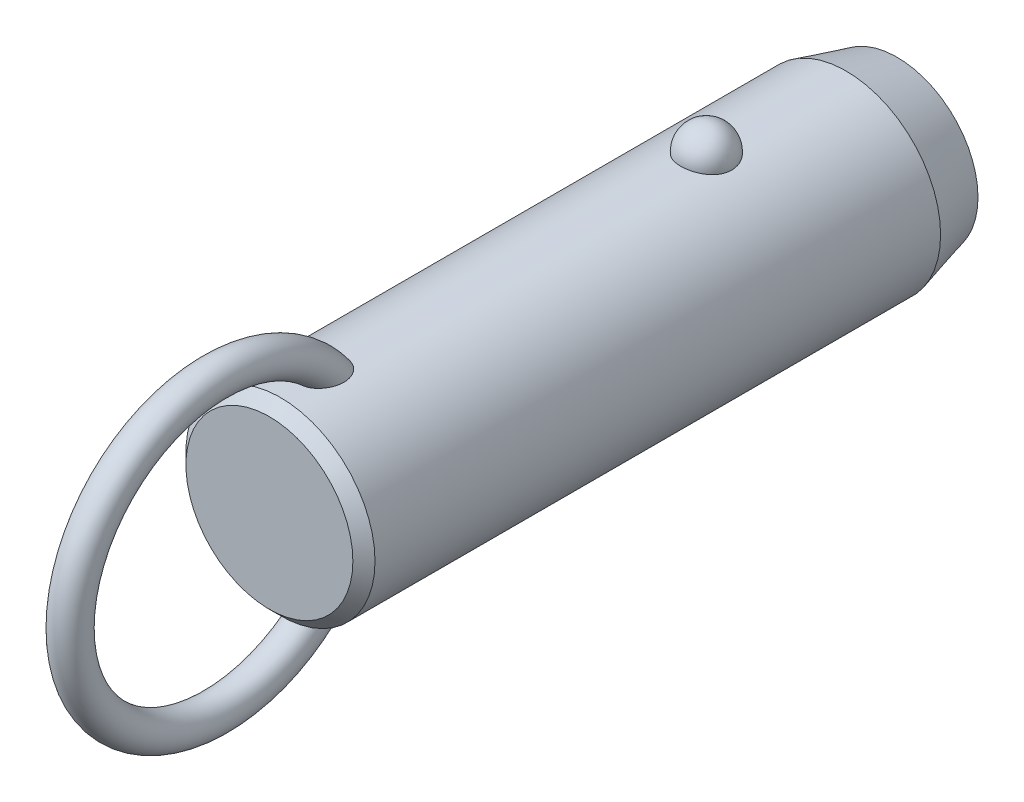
ISO-10303-21;
HEADER;
FILE_DESCRIPTION(('STEP AP214'),'2;1');
FILE_NAME('part.step','',(''),(''),'','','');
FILE_SCHEMA(('AUTOMOTIVE_DESIGN { 1 0 10303 214 1 1 1 1 }'));
ENDSEC;
DATA;
#1=APPLICATION_CONTEXT('core data for automotive mechanical design processes');
#2=APPLICATION_PROTOCOL_DEFINITION('international standard','automotive_design',2000,#1);
#3=PRODUCT_CONTEXT('',#1,'mechanical');
#4=PRODUCT('Part','Part','',(#3));
#5=PRODUCT_RELATED_PRODUCT_CATEGORY('part','',(#4));
#6=PRODUCT_DEFINITION_FORMATION('','',#4);
#7=PRODUCT_DEFINITION_CONTEXT('part definition',#1,'design');
#8=PRODUCT_DEFINITION('design','',#6,#7);
#9=PRODUCT_DEFINITION_SHAPE('','',#8);
#10=(LENGTH_UNIT() NAMED_UNIT(*) SI_UNIT(.MILLI.,.METRE.));
#11=(NAMED_UNIT(*) PLANE_ANGLE_UNIT() SI_UNIT($,.RADIAN.));
#12=(NAMED_UNIT(*) SI_UNIT($,.STERADIAN.) SOLID_ANGLE_UNIT());
#13=UNCERTAINTY_MEASURE_WITH_UNIT(LENGTH_MEASURE(1.E-05),#10,'distance_accuracy_value','');
#14=(GEOMETRIC_REPRESENTATION_CONTEXT(3) GLOBAL_UNCERTAINTY_ASSIGNED_CONTEXT((#13)) GLOBAL_UNIT_ASSIGNED_CONTEXT((#10,
#11,#12)) REPRESENTATION_CONTEXT('',''));
#15=CARTESIAN_POINT('',(0.,0.,0.));
#16=DIRECTION('',(0.,0.,1.));
#17=DIRECTION('',(1.,0.,0.));
#18=AXIS2_PLACEMENT_3D('',#15,#16,#17);
#19=CARTESIAN_POINT('',(0.,0.,35.6));
#20=DIRECTION('',(0.,0.,-1.));
#21=DIRECTION('',(-1.,0.,0.));
#22=AXIS2_PLACEMENT_3D('',#19,#20,#21);
#23=CYLINDRICAL_SURFACE('',#22,11.1);
#24=CARTESIAN_POINT('',(2.9724815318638,10.6945945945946,-3.));
#25=CARTESIAN_POINT('',(2.97247830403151,10.6945972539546,-2.83225059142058));
#26=CARTESIAN_POINT('',(2.95876598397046,10.6984356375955,-2.6644597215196));
#27=CARTESIAN_POINT('',(2.90424529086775,10.7133624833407,-2.33362381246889));
#28=CARTESIAN_POINT('',(2.8634252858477,10.7244540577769,-2.1705808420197));
#29=CARTESIAN_POINT('',(2.75573657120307,10.7526272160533,-1.85396767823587));
#30=CARTESIAN_POINT('',(2.68887937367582,10.7697061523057,-1.70039333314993));
#31=CARTESIAN_POINT('',(2.53079696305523,10.8079438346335,-1.40691598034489));
#32=CARTESIAN_POINT('',(2.43957264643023,10.8291024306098,-1.2670124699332));
#33=CARTESIAN_POINT('',(2.23458150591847,10.8732541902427,-1.00409565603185));
#34=CARTESIAN_POINT('',(2.12071295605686,10.8962553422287,-0.881162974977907));
#35=CARTESIAN_POINT('',(1.87365402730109,10.9414421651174,-0.656352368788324));
#36=CARTESIAN_POINT('',(1.74046358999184,10.9636278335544,-0.554474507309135));
#37=CARTESIAN_POINT('',(1.45872188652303,11.0046495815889,-0.374872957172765));
#38=CARTESIAN_POINT('',(1.31021276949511,11.0234944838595,-0.29708522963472));
#39=CARTESIAN_POINT('',(1.00170030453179,11.0557957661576,-0.167529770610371));
#40=CARTESIAN_POINT('',(0.841698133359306,11.0692526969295,-0.115759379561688));
#41=CARTESIAN_POINT('',(0.517607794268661,11.0890932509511,-0.0403925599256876));
#42=CARTESIAN_POINT('',(0.353633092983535,11.0955916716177,-0.0163383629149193));
#43=CARTESIAN_POINT('',(0.0238420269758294,11.1011989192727,0.00445177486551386));
#44=CARTESIAN_POINT('',(-0.141974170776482,11.1003084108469,0.00119017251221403));
#45=CARTESIAN_POINT('',(-0.468405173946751,11.0912990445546,-0.0323233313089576));
#46=CARTESIAN_POINT('',(-0.629059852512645,11.0832767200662,-0.0622147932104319));
#47=CARTESIAN_POINT('',(-0.942937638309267,11.0609962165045,-0.147645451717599));
#48=CARTESIAN_POINT('',(-1.09616062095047,11.0467379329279,-0.203185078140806));
#49=CARTESIAN_POINT('',(-1.39181061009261,11.0134071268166,-0.338752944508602));
#50=CARTESIAN_POINT('',(-1.53417383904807,10.9943086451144,-0.418913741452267));
#51=CARTESIAN_POINT('',(-1.80342160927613,10.9533667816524,-0.601448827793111));
#52=CARTESIAN_POINT('',(-1.9303046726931,10.9315231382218,-0.70382523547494));
#53=CARTESIAN_POINT('',(-2.16747598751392,10.887005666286,-0.930091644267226));
#54=CARTESIAN_POINT('',(-2.27742774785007,10.8643239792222,-1.05433291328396));
#55=CARTESIAN_POINT('',(-2.47517316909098,10.8209886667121,-1.31966633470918));
#56=CARTESIAN_POINT('',(-2.56296538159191,10.8003351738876,-1.46075958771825));
#57=CARTESIAN_POINT('',(-2.71500300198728,10.7631304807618,-1.75753646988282));
#58=CARTESIAN_POINT('',(-2.77898901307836,10.7466250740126,-1.91335887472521));
#59=CARTESIAN_POINT('',(-2.88046189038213,10.7198747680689,-2.2339152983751));
#60=CARTESIAN_POINT('',(-2.91794947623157,10.709629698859,-2.39864907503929));
#61=CARTESIAN_POINT('',(-2.96537819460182,10.6965949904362,-2.73165170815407));
#62=CARTESIAN_POINT('',(-2.97542891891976,10.693775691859,-2.89990378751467));
#63=CARTESIAN_POINT('',(-2.96804271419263,10.6958279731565,-3.235752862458));
#64=CARTESIAN_POINT('',(-2.95060646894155,10.7006993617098,-3.40334987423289));
#65=CARTESIAN_POINT('',(-2.88883358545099,10.71753912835,-3.73233906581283));
#66=CARTESIAN_POINT('',(-2.84462026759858,10.7294749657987,-3.89375610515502));
#67=CARTESIAN_POINT('',(-2.73050447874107,10.7590797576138,-4.20667949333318));
#68=CARTESIAN_POINT('',(-2.66060103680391,10.7767489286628,-4.35818546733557));
#69=CARTESIAN_POINT('',(-2.49642559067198,10.8159599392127,-4.6478542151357));
#70=CARTESIAN_POINT('',(-2.40203047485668,10.8375211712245,-4.78594458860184));
#71=CARTESIAN_POINT('',(-2.19143488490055,10.8820570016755,-5.0441038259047));
#72=CARTESIAN_POINT('',(-2.07523364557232,10.9050316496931,-5.16417205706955));
#73=CARTESIAN_POINT('',(-1.82361254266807,10.9499219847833,-5.38334833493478));
#74=CARTESIAN_POINT('',(-1.68812945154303,10.9718338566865,-5.48238464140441));
#75=CARTESIAN_POINT('',(-1.40191298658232,11.0120611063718,-5.65618873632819));
#76=CARTESIAN_POINT('',(-1.25118062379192,11.0303767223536,-5.73095813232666));
#77=CARTESIAN_POINT('',(-0.940570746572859,11.0611653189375,-5.85334725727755));
#78=CARTESIAN_POINT('',(-0.780821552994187,11.0737044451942,-5.901275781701));
#79=CARTESIAN_POINT('',(-0.455204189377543,11.0918598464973,-5.96992976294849));
#80=CARTESIAN_POINT('',(-0.289336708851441,11.0974768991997,-5.99065827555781));
#81=CARTESIAN_POINT('',(0.0406846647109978,11.1011307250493,-6.00418773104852));
#82=CARTESIAN_POINT('',(0.204817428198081,11.099299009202,-5.99747318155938));
#83=CARTESIAN_POINT('',(0.5295530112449,11.088551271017,-5.9574031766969));
#84=CARTESIAN_POINT('',(0.69015594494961,11.0796354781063,-5.92404858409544));
#85=CARTESIAN_POINT('',(1.0027760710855,11.0557204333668,-5.83180084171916));
#86=CARTESIAN_POINT('',(1.15482001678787,11.0407414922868,-5.77299291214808));
#87=CARTESIAN_POINT('',(1.44678373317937,11.0062913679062,-5.63147366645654));
#88=CARTESIAN_POINT('',(1.58670279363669,10.9868199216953,-5.54876095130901));
#89=CARTESIAN_POINT('',(1.8527023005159,10.9451315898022,-5.36027644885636));
#90=CARTESIAN_POINT('',(1.97855158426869,10.9228788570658,-5.25418644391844));
#91=CARTESIAN_POINT('',(2.21080872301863,10.8782509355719,-5.02251354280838));
#92=CARTESIAN_POINT('',(2.31721312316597,10.8558757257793,-4.89692718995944));
#93=CARTESIAN_POINT('',(2.5094551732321,10.8130715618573,-4.62745408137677));
#94=CARTESIAN_POINT('',(2.59493284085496,10.7926798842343,-4.48330448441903));
#95=CARTESIAN_POINT('',(2.740862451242,10.7565495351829,-4.18236358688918));
#96=CARTESIAN_POINT('',(2.80132490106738,10.7408089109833,-4.02557762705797));
#97=CARTESIAN_POINT('',(2.88959070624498,10.7173718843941,-3.72475308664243));
#98=CARTESIAN_POINT('',(2.92062102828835,10.7088950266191,-3.58171216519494));
#99=CARTESIAN_POINT('',(2.96206765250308,10.6975052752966,-3.29245795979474));
#100=CARTESIAN_POINT('',(2.97248434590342,10.6945922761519,-3.14624473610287));
#101=CARTESIAN_POINT('',(2.9724815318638,10.6945945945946,-3.));
#102=B_SPLINE_CURVE_WITH_KNOTS('',3,(#24,#25,#26,#27,#28,#29,#30,#31,#32,#33,#34,#35,#36,#37,
#38,#39,#40,#41,#42,#43,#44,#45,#46,#47,#48,#49,#50,#51,#52,#53,#54,#55,#56,#57,#58,#59,#60,#61,
#62,#63,#64,#65,#66,#67,#68,#69,#70,#71,#72,#73,#74,#75,#76,#77,#78,#79,#80,#81,#82,#83,#84,#85,
#86,#87,#88,#89,#90,#91,#92,#93,#94,#95,#96,#97,#98,#99,#100,#101),.UNSPECIFIED.,.T.,.F.,(4,2,2,
2,2,2,2,2,2,2,2,2,2,2,2,2,2,2,2,2,2,2,2,2,2,2,2,2,2,2,2,2,2,2,2,2,2,2,4),(0.,0.502722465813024,
1.00566079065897,1.5083769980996,2.01107471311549,2.51608392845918,3.02109467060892,
3.52475118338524,4.02835620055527,4.523518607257,5.0186364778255,5.50715297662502,
5.9956776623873,6.48688002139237,6.97812923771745,7.47814366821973,7.9781907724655,
8.48353712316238,8.9888697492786,9.49218093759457,9.99547960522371,10.4964777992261,
10.997494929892,11.5010810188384,12.0046847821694,12.5099796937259,13.0152411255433,
13.5145635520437,14.0138298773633,14.5043200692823,14.9947943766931,15.4836390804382,
15.9725123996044,16.4685040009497,16.9645836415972,17.4686765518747,17.972557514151,
18.410841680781,18.849117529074),.UNSPECIFIED.);
#103=CARTESIAN_POINT('',(2.9724815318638,10.6945945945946,-3.));
#104=VERTEX_POINT('',#103);
#105=EDGE_CURVE('E41',#104,#104,#102,.T.);
#106=ORIENTED_EDGE('',*,*,#105,.T.);
#107=EDGE_LOOP('',(#106));
#108=FACE_BOUND('',#107,.T.);
#109=CARTESIAN_POINT('',(0.,0.,47.));
#110=DIRECTION('',(0.,0.,1.));
#111=DIRECTION('',(1.,0.,0.));
#112=AXIS2_PLACEMENT_3D('',#109,#110,#111);
#113=CIRCLE('',#112,11.1);
#114=CARTESIAN_POINT('',(11.1,0.,47.));
#115=VERTEX_POINT('',#114);
#116=EDGE_CURVE('E10',#115,#115,#113,.F.);
#117=ORIENTED_EDGE('',*,*,#116,.T.);
#118=EDGE_LOOP('',(#117));
#119=FACE_BOUND('',#118,.T.);
#120=CARTESIAN_POINT('',(-0.564520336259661,-11.0856356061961,39.257815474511));
#121=CARTESIAN_POINT('',(-0.667202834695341,-11.0804062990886,39.2912839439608));
#122=CARTESIAN_POINT('',(-0.766875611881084,-11.0738877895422,39.3338357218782));
#123=CARTESIAN_POINT('',(-0.957284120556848,-11.0590576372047,39.4354190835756));
#124=CARTESIAN_POINT('',(-1.04801616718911,-11.0507452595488,39.4944574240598));
#125=CARTESIAN_POINT('',(-1.21800952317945,-11.0333016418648,39.6265293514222));
#126=CARTESIAN_POINT('',(-1.29730805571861,-11.0241732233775,39.6995156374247));
#127=CARTESIAN_POINT('',(-1.44337665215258,-11.0060026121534,39.8570374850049));
#128=CARTESIAN_POINT('',(-1.51014622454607,-10.9969604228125,39.9415734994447));
#129=CARTESIAN_POINT('',(-1.63454620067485,-10.9791841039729,40.1255213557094));
#130=CARTESIAN_POINT('',(-1.69127003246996,-10.9705107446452,40.2255493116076));
#131=CARTESIAN_POINT('',(-1.78980785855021,-10.9548648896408,40.4327902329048));
#132=CARTESIAN_POINT('',(-1.83161214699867,-10.9478935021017,40.5400078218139));
#133=CARTESIAN_POINT('',(-1.91557028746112,-10.9335803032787,40.8054080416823));
#134=CARTESIAN_POINT('',(-1.95040620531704,-10.9273269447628,40.9659806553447));
#135=CARTESIAN_POINT('',(-1.99388326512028,-10.9194709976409,41.2906977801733));
#136=CARTESIAN_POINT('',(-2.00248051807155,-10.9178762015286,41.4548478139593));
#137=CARTESIAN_POINT('',(-1.99551615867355,-10.9191578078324,41.8246504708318));
#138=CARTESIAN_POINT('',(-1.9732206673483,-10.9232807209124,42.0301911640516));
#139=CARTESIAN_POINT('',(-1.9152976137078,-10.9335244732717,42.333595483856));
#140=CARTESIAN_POINT('',(-1.89184575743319,-10.9376266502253,42.4340883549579));
#141=CARTESIAN_POINT('',(-1.83700674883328,-10.9469720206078,42.632855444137));
#142=CARTESIAN_POINT('',(-1.80562070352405,-10.9522150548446,42.7311299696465));
#143=CARTESIAN_POINT('',(-1.73463055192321,-10.9636837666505,42.9259148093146));
#144=CARTESIAN_POINT('',(-1.69493416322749,-10.9699202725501,43.0223907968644));
#145=CARTESIAN_POINT('',(-1.60745141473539,-10.9830806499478,43.2116262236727));
#146=CARTESIAN_POINT('',(-1.55966150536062,-10.9900048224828,43.3043840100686));
#147=CARTESIAN_POINT('',(-1.45591812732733,-11.0042280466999,43.4846907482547));
#148=CARTESIAN_POINT('',(-1.40000013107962,-11.0115253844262,43.5722601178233));
#149=CARTESIAN_POINT('',(-1.27937470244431,-11.0261911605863,43.741029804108));
#150=CARTESIAN_POINT('',(-1.21467835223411,-11.0335594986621,43.8222379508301));
#151=CARTESIAN_POINT('',(-1.08218150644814,-11.0473027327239,43.9690010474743));
#152=CARTESIAN_POINT('',(-1.01522633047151,-11.0537063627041,44.0353092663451));
#153=CARTESIAN_POINT('',(-0.872952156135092,-11.065850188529,44.1583780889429));
#154=CARTESIAN_POINT('',(-0.797642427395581,-11.0715911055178,44.2151491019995));
#155=CARTESIAN_POINT('',(-0.651396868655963,-11.081071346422,44.3075155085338));
#156=CARTESIAN_POINT('',(-0.581712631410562,-11.0849841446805,44.3450491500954));
#157=CARTESIAN_POINT('',(-0.437066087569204,-11.0916271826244,44.4082594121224));
#158=CARTESIAN_POINT('',(-0.362109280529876,-11.0943586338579,44.4339481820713));
#159=CARTESIAN_POINT('',(-0.207828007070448,-11.0983242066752,44.471117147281));
#160=CARTESIAN_POINT('',(-0.128467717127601,-11.0995432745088,44.4824545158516));
#161=CARTESIAN_POINT('',(0.0309101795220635,-11.1002423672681,44.4889658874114));
#162=CARTESIAN_POINT('',(0.110927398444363,-11.0997233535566,44.4841488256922));
#163=CARTESIAN_POINT('',(0.256406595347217,-11.097240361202,44.4609599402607));
#164=CARTESIAN_POINT('',(0.322235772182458,-11.0955074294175,44.4447543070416));
#165=CARTESIAN_POINT('',(0.450635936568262,-11.0910350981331,44.4026008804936));
#166=CARTESIAN_POINT('',(0.513205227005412,-11.0882951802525,44.3766480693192));
#167=CARTESIAN_POINT('',(0.662626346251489,-11.0805620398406,44.3026073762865));
#168=CARTESIAN_POINT('',(0.747127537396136,-11.0751144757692,44.2498452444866));
#169=CARTESIAN_POINT('',(0.906756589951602,-11.0631932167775,44.1317206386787));
#170=CARTESIAN_POINT('',(0.981859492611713,-11.0567168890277,44.0663257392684));
#171=CARTESIAN_POINT('',(1.1071220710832,-11.0447856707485,43.9422633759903));
#172=CARTESIAN_POINT('',(1.15909566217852,-11.0394280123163,43.8853831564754));
#173=CARTESIAN_POINT('',(1.25791923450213,-11.0286040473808,43.7673271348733));
#174=CARTESIAN_POINT('',(1.30476642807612,-11.0231376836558,43.7061490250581));
#175=CARTESIAN_POINT('',(1.43818612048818,-11.0068027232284,43.517305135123));
#176=CARTESIAN_POINT('',(1.51751767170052,-10.9960104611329,43.3844531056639));
#177=CARTESIAN_POINT('',(1.63597546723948,-10.9788847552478,43.1531371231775));
#178=CARTESIAN_POINT('',(1.67988876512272,-10.9722190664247,43.0570530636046));
#179=CARTESIAN_POINT('',(1.75953241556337,-10.9597298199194,42.8614311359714));
#180=CARTESIAN_POINT('',(1.79525967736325,-10.9539065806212,42.7618919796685));
#181=CARTESIAN_POINT('',(1.85844731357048,-10.9433632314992,42.5602111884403));
#182=CARTESIAN_POINT('',(1.88591073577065,-10.9386427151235,42.4580705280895));
#183=CARTESIAN_POINT('',(1.93234324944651,-10.9305350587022,42.251819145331));
#184=CARTESIAN_POINT('',(1.95131065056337,-10.9271481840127,42.1477080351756));
#185=CARTESIAN_POINT('',(1.99040203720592,-10.9201183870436,41.8654588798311));
#186=CARTESIAN_POINT('',(2.00221217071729,-10.9179256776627,41.6860370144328));
#187=CARTESIAN_POINT('',(1.99711676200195,-10.9188636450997,41.3277133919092));
#188=CARTESIAN_POINT('',(1.98026150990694,-10.9219849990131,41.1488112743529));
#189=CARTESIAN_POINT('',(1.92151657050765,-10.9324473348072,40.8364514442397));
#190=CARTESIAN_POINT('',(1.88605081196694,-10.9386915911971,40.7017594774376));
#191=CARTESIAN_POINT('',(1.79393020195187,-10.9541780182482,40.439966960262));
#192=CARTESIAN_POINT('',(1.73729868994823,-10.9634168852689,40.3128582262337));
#193=CARTESIAN_POINT('',(1.61237037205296,-10.9824218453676,40.0894184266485));
#194=CARTESIAN_POINT('',(1.54715374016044,-10.9918945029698,39.9913455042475));
#195=CARTESIAN_POINT('',(1.40127026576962,-11.0114415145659,39.8074341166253));
#196=CARTESIAN_POINT('',(1.32060742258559,-11.0215157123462,39.7215924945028));
#197=CARTESIAN_POINT('',(1.1447478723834,-11.041168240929,39.5651630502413));
#198=CARTESIAN_POINT('',(1.0494780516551,-11.0507437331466,39.4946565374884));
#199=CARTESIAN_POINT('',(0.847278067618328,-11.0680789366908,39.372640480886));
#200=CARTESIAN_POINT('',(0.740351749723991,-11.0758392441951,39.3211246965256));
#201=CARTESIAN_POINT('',(0.529289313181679,-11.0878275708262,39.2434852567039));
#202=CARTESIAN_POINT('',(0.425895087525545,-11.0923259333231,39.215377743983));
#203=CARTESIAN_POINT('',(0.215723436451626,-11.0984001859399,39.1777038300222));
#204=CARTESIAN_POINT('',(0.108947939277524,-11.0999777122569,39.1681270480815));
#205=CARTESIAN_POINT('',(-0.0938962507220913,-11.1000196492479,39.1678773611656));
#206=CARTESIAN_POINT('',(-0.189967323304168,-11.0987797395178,39.1754089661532));
#207=CARTESIAN_POINT('',(-0.379657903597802,-11.0939111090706,39.2055079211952));
#208=CARTESIAN_POINT('',(-0.473277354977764,-11.0902823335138,39.2280756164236));
#209=CARTESIAN_POINT('',(-0.564520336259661,-11.0856356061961,39.257815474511));
#210=B_SPLINE_CURVE_WITH_KNOTS('',3,(#120,#121,#122,#123,#124,#125,#126,#127,#128,#129,#130,
#131,#132,#133,#134,#135,#136,#137,#138,#139,#140,#141,#142,#143,#144,#145,#146,#147,#148,#149,
#150,#151,#152,#153,#154,#155,#156,#157,#158,#159,#160,#161,#162,#163,#164,#165,#166,#167,#168,
#169,#170,#171,#172,#173,#174,#175,#176,#177,#178,#179,#180,#181,#182,#183,#184,#185,#186,#187,
#188,#189,#190,#191,#192,#193,#194,#195,#196,#197,#198,#199,#200,#201,#202,#203,#204,#205,#206,
#207,#208,#209),.UNSPECIFIED.,.T.,.F.,(4,2,2,2,2,2,2,2,2,2,2,2,2,2,2,2,2,2,2,2,2,2,2,2,2,2,2,2,
2,2,2,2,2,2,2,2,2,2,2,2,2,2,2,2,4),(0.,0.323999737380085,0.648132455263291,0.97118486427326,
1.29424994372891,1.63886237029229,1.98369857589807,2.47426059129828,2.96564271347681,
3.58257396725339,3.89215258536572,4.20168803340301,4.51486273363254,4.82817514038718,
5.1401591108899,5.45175282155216,5.73442856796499,6.01679375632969,6.25364580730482,
6.49025437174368,6.72919963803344,6.9680127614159,7.17061258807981,7.37331685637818,
7.67094989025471,7.96935728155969,8.20075067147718,8.43226927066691,8.89581623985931,
9.2130653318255,9.53043400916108,9.84768549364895,10.1650000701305,10.70229304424,
11.2386443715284,11.6553390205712,12.0715755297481,12.4245637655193,12.7774607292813,
13.1321855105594,13.4867936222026,13.8068771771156,14.1267813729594,14.4146787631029,
14.7025827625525),.UNSPECIFIED.);
#211=CARTESIAN_POINT('',(-0.564520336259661,-11.0856356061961,39.257815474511));
#212=VERTEX_POINT('',#211);
#213=EDGE_CURVE('E60',#212,#212,#210,.T.);
#214=ORIENTED_EDGE('',*,*,#213,.T.);
#215=EDGE_LOOP('',(#214));
#216=FACE_BOUND('',#215,.T.);
#217=CARTESIAN_POINT('',(-0.564520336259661,11.0856356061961,39.257815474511));
#218=CARTESIAN_POINT('',(-0.468542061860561,11.0905203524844,39.2265456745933));
#219=CARTESIAN_POINT('',(-0.369793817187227,11.0942886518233,39.2031576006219));
#220=CARTESIAN_POINT('',(-0.16955579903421,11.0991586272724,39.1730858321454));
#221=CARTESIAN_POINT('',(-0.068060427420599,11.1002543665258,39.1664393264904));
#222=CARTESIAN_POINT('',(0.134549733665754,11.099646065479,39.1701579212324));
#223=CARTESIAN_POINT('',(0.235664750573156,11.0979441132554,39.1805103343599));
#224=CARTESIAN_POINT('',(0.43463240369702,11.0919342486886,39.2178318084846));
#225=CARTESIAN_POINT('',(0.532486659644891,11.0876276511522,39.2447924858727));
#226=CARTESIAN_POINT('',(0.722445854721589,11.0768742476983,39.3144096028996));
#227=CARTESIAN_POINT('',(0.814543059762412,11.0704246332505,39.3570866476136));
#228=CARTESIAN_POINT('',(0.990565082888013,11.0560659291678,39.4566487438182));
#229=CARTESIAN_POINT('',(1.07448844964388,11.048156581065,39.5135363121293));
#230=CARTESIAN_POINT('',(1.23562672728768,11.0313221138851,39.6422106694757));
#231=CARTESIAN_POINT('',(1.31242684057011,11.0223686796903,39.7145117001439));
#232=CARTESIAN_POINT('',(1.45398030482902,11.0045918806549,39.8700425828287));
#233=CARTESIAN_POINT('',(1.51873073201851,10.9957685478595,39.9532750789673));
#234=CARTESIAN_POINT('',(1.64107232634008,10.9782087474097,40.1363842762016));
#235=CARTESIAN_POINT('',(1.6974317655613,10.9695572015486,40.2370893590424));
#236=CARTESIAN_POINT('',(1.79515063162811,10.9539887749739,40.4456264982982));
#237=CARTESIAN_POINT('',(1.83649966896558,10.9470730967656,40.5534634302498));
#238=CARTESIAN_POINT('',(1.91931148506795,10.9329211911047,40.8203995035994));
#239=CARTESIAN_POINT('',(1.95340104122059,10.9267904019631,40.9818612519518));
#240=CARTESIAN_POINT('',(1.99526195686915,10.9192174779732,41.3082163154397));
#241=CARTESIAN_POINT('',(2.00298989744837,10.9177830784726,41.4731148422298));
#242=CARTESIAN_POINT('',(1.99396251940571,10.9194420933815,41.8441006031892));
#243=CARTESIAN_POINT('',(1.97050829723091,10.923774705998,42.0500387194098));
#244=CARTESIAN_POINT('',(1.91079643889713,10.9343131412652,42.3539019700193));
#245=CARTESIAN_POINT('',(1.8867370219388,10.9385106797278,42.4545296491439));
#246=CARTESIAN_POINT('',(1.83065508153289,10.9480376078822,42.6535107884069));
#247=CARTESIAN_POINT('',(1.79863369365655,10.9533668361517,42.751864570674));
#248=CARTESIAN_POINT('',(1.72633365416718,10.9649954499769,42.9467203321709));
#249=CARTESIAN_POINT('',(1.68596409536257,10.9713053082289,43.0431879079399));
#250=CARTESIAN_POINT('',(1.59707998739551,10.9845964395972,43.2323233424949));
#251=CARTESIAN_POINT('',(1.54856169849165,10.9915780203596,43.3249894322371));
#252=CARTESIAN_POINT('',(1.44330168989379,11.0058935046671,43.5049752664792));
#253=CARTESIAN_POINT('',(1.38659749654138,11.0132257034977,43.592316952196));
#254=CARTESIAN_POINT('',(1.26431158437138,11.0279330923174,43.7604563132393));
#255=CARTESIAN_POINT('',(1.198741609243,11.0353082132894,43.8412624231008));
#256=CARTESIAN_POINT('',(1.06542088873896,11.048931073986,43.9859856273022));
#257=CARTESIAN_POINT('',(0.998640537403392,11.0552153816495,44.050784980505));
#258=CARTESIAN_POINT('',(0.856896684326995,11.0671032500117,44.1708462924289));
#259=CARTESIAN_POINT('',(0.781942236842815,11.0727075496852,44.2261186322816));
#260=CARTESIAN_POINT('',(0.636276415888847,11.081949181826,44.3159721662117));
#261=CARTESIAN_POINT('',(0.566755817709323,11.0857572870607,44.3524410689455));
#262=CARTESIAN_POINT('',(0.422602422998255,11.0921860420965,44.4135333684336));
#263=CARTESIAN_POINT('',(0.347974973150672,11.0948079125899,44.4381689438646));
#264=CARTESIAN_POINT('',(0.194593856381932,11.0985608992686,44.4733233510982));
#265=CARTESIAN_POINT('',(0.115807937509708,11.0996777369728,44.4837069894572));
#266=CARTESIAN_POINT('',(-0.0422499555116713,11.1002003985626,44.4885747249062));
#267=CARTESIAN_POINT('',(-0.121521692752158,11.09960699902,44.483066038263));
#268=CARTESIAN_POINT('',(-0.266046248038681,11.0970123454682,44.4588271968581));
#269=CARTESIAN_POINT('',(-0.331661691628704,11.0952283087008,44.4421356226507));
#270=CARTESIAN_POINT('',(-0.459588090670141,11.0906663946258,44.3991117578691));
#271=CARTESIAN_POINT('',(-0.521897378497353,11.0878880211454,44.372774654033));
#272=CARTESIAN_POINT('',(-0.671446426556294,11.0800342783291,44.2975130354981));
#273=CARTESIAN_POINT('',(-0.75625045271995,11.0744969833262,44.2438182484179));
#274=CARTESIAN_POINT('',(-0.91634957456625,11.0624045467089,44.1238029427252));
#275=CARTESIAN_POINT('',(-0.991618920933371,11.0558467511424,44.0574493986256));
#276=CARTESIAN_POINT('',(-1.11713140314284,11.0437783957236,43.9316335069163));
#277=CARTESIAN_POINT('',(-1.16920539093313,11.0383619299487,43.8739524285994));
#278=CARTESIAN_POINT('',(-1.26817476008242,11.02743010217,43.7542809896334));
#279=CARTESIAN_POINT('',(-1.315067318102,11.0219146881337,43.6922883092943));
#280=CARTESIAN_POINT('',(-1.40399813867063,11.0109399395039,43.5647843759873));
#281=CARTESIAN_POINT('',(-1.4460286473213,11.0054807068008,43.4992677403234));
#282=CARTESIAN_POINT('',(-1.52538779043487,10.9947621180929,43.3654223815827));
#283=CARTESIAN_POINT('',(-1.56271516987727,10.9895028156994,43.2970929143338));
#284=CARTESIAN_POINT('',(-1.64537943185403,10.9774790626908,43.1332101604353));
#285=CARTESIAN_POINT('',(-1.68879497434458,10.9708503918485,43.0366735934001));
#286=CARTESIAN_POINT('',(-1.76740738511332,10.9584602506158,42.8402369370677));
#287=CARTESIAN_POINT('',(-1.80260120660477,10.95269910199,42.7403356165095));
#288=CARTESIAN_POINT('',(-1.86468657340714,10.9423003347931,42.5379663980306));
#289=CARTESIAN_POINT('',(-1.8915816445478,10.9376622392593,42.4354996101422));
#290=CARTESIAN_POINT('',(-1.93682458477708,10.9297405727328,42.2286429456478));
#291=CARTESIAN_POINT('',(-1.95517082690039,10.9264572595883,42.1242527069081));
#292=CARTESIAN_POINT('',(-1.99232562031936,10.9197647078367,41.8426287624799));
#293=CARTESIAN_POINT('',(-2.00294603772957,10.9177914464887,41.6641857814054));
#294=CARTESIAN_POINT('',(-1.99566675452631,10.9191290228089,41.3079962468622));
#295=CARTESIAN_POINT('',(-1.97781651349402,10.9224306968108,41.1302490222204));
#296=CARTESIAN_POINT('',(-1.91747214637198,10.93315926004,40.8197921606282));
#297=CARTESIAN_POINT('',(-1.88131022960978,10.9395108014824,40.685825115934));
#298=CARTESIAN_POINT('',(-1.78790380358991,10.9551659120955,40.4255975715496));
#299=CARTESIAN_POINT('',(-1.7306830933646,10.9644661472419,40.2993285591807));
#300=CARTESIAN_POINT('',(-1.60475573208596,10.9835398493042,40.0774156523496));
#301=CARTESIAN_POINT('',(-1.53908879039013,10.9930297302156,39.9800265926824));
#302=CARTESIAN_POINT('',(-1.39238608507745,11.0125708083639,39.7975250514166));
#303=CARTESIAN_POINT('',(-1.31135150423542,11.0226219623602,39.7124116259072));
#304=CARTESIAN_POINT('',(-1.14382035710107,11.0411991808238,39.5652994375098));
#305=CARTESIAN_POINT('',(-1.05858500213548,11.0497792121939,39.5018693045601));
#306=CARTESIAN_POINT('',(-0.878723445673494,11.0655285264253,39.3902505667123));
#307=CARTESIAN_POINT('',(-0.78412346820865,11.0727015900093,39.3420208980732));
#308=CARTESIAN_POINT('',(-0.646163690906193,11.0812501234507,39.286023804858));
#309=CARTESIAN_POINT('',(-0.605595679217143,11.0835451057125,39.2711978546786));
#310=CARTESIAN_POINT('',(-0.564520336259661,11.0856356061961,39.257815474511));
#311=B_SPLINE_CURVE_WITH_KNOTS('',3,(#217,#218,#219,#220,#221,#222,#223,#224,#225,#226,#227,
#228,#229,#230,#231,#232,#233,#234,#235,#236,#237,#238,#239,#240,#241,#242,#243,#244,#245,#246,
#247,#248,#249,#250,#251,#252,#253,#254,#255,#256,#257,#258,#259,#260,#261,#262,#263,#264,#265,
#266,#267,#268,#269,#270,#271,#272,#273,#274,#275,#276,#277,#278,#279,#280,#281,#282,#283,#284,
#285,#286,#287,#288,#289,#290,#291,#292,#293,#294,#295,#296,#297,#298,#299,#300,#301,#302,#303,
#304,#305,#306,#307,#308,#309,#310),.UNSPECIFIED.,.T.,.F.,(4,2,2,2,2,2,2,2,2,2,2,2,2,2,2,2,2,2,
2,2,2,2,2,2,2,2,2,2,2,2,2,2,2,2,2,2,2,2,2,2,2,2,2,2,2,2,4),(0.,0.303061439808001,
0.60679549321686,0.910302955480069,1.21365733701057,1.51741085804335,1.82121821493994,
2.13745205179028,2.45376252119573,2.79958678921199,3.14564996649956,3.6383239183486,
4.13180893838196,4.75031912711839,5.06071926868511,5.37107516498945,5.68500772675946,
5.99908475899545,6.31176519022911,6.62403542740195,6.90315673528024,7.18197194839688,
7.41687778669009,7.6515413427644,7.88841587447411,8.12518286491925,8.32752842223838,
8.5299750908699,8.82986421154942,9.13054668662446,9.36393502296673,9.59744991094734,
9.83133221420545,10.0652767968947,10.383032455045,10.7009056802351,11.0186436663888,
11.3364420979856,11.8705925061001,12.4038159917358,12.8189662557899,13.2336487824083,
13.5857049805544,13.9377340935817,14.2561354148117,14.5736690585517,14.7033687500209),.UNSPECIFIED.);
#312=CARTESIAN_POINT('',(-0.564520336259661,11.0856356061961,39.257815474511));
#313=VERTEX_POINT('',#312);
#314=EDGE_CURVE('E68',#313,#313,#311,.T.);
#315=ORIENTED_EDGE('',*,*,#314,.T.);
#316=EDGE_LOOP('',(#315));
#317=FACE_BOUND('',#316,.T.);
#318=CARTESIAN_POINT('',(0.,0.,-19.4));
#319=DIRECTION('',(0.,0.,-1.));
#320=DIRECTION('',(-1.,0.,0.));
#321=AXIS2_PLACEMENT_3D('',#318,#319,#320);
#322=CIRCLE('',#321,11.1);
#323=CARTESIAN_POINT('',(11.1,0.,-19.3999999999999));
#324=VERTEX_POINT('',#323);
#325=EDGE_CURVE('E57',#324,#324,#322,.F.);
#326=ORIENTED_EDGE('',*,*,#325,.T.);
#327=EDGE_LOOP('',(#326));
#328=FACE_BOUND('',#327,.T.);
#329=ADVANCED_FACE('F37',(#108,#119,#216,#317,#328),#23,.T.);
#330=CARTESIAN_POINT('',(0.,0.,-25.4));
#331=DIRECTION('',(0.,0.,-1.));
#332=DIRECTION('',(-1.,0.,0.));
#333=AXIS2_PLACEMENT_3D('',#330,#331,#332);
#334=PLANE('',#333);
#335=CARTESIAN_POINT('',(0.,0.,-25.4));
#336=DIRECTION('',(0.,0.,-1.));
#337=DIRECTION('',(-1.,0.,0.));
#338=AXIS2_PLACEMENT_3D('',#335,#336,#337);
#339=CIRCLE('',#338,9.49230484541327);
#340=CARTESIAN_POINT('',(9.49230484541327,0.,-25.4));
#341=VERTEX_POINT('',#340);
#342=EDGE_CURVE('E67',#341,#341,#339,.T.);
#343=ORIENTED_EDGE('',*,*,#342,.T.);
#344=EDGE_LOOP('',(#343));
#345=FACE_BOUND('',#344,.T.);
#346=ADVANCED_FACE('F86',(#345),#334,.T.);
#347=CARTESIAN_POINT('',(0.,0.,-25.4));
#348=DIRECTION('',(0.,0.,1.));
#349=DIRECTION('',(1.,0.,0.));
#350=AXIS2_PLACEMENT_3D('',#347,#348,#349);
#351=CONICAL_SURFACE('',#350,9.49230484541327,0.261799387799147);
#352=CARTESIAN_POINT('',(11.1,0.,-19.3999999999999));
#353=CARTESIAN_POINT('',(11.0832531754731,0.,-19.4624999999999));
#354=CARTESIAN_POINT('',(11.0665063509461,0.,-19.525));
#355=CARTESIAN_POINT('',(11.0330127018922,0.,-19.65));
#356=CARTESIAN_POINT('',(11.0162658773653,0.,-19.7125));
#357=CARTESIAN_POINT('',(10.9827722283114,0.,-19.8375));
#358=CARTESIAN_POINT('',(10.9660254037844,0.,-19.9));
#359=CARTESIAN_POINT('',(10.9325317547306,0.,-20.025));
#360=CARTESIAN_POINT('',(10.9157849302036,0.,-20.0875));
#361=CARTESIAN_POINT('',(10.8822912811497,0.,-20.2125));
#362=CARTESIAN_POINT('',(10.8655444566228,0.,-20.275));
#363=CARTESIAN_POINT('',(10.8320508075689,0.,-20.4));
#364=CARTESIAN_POINT('',(10.8153039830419,0.,-20.4625));
#365=CARTESIAN_POINT('',(10.781810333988,0.,-20.5875));
#366=CARTESIAN_POINT('',(10.7650635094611,0.,-20.65));
#367=CARTESIAN_POINT('',(10.7315698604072,0.,-20.775));
#368=CARTESIAN_POINT('',(10.7148230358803,0.,-20.8375));
#369=CARTESIAN_POINT('',(10.6813293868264,0.,-20.9625));
#370=CARTESIAN_POINT('',(10.6645825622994,0.,-21.025));
#371=CARTESIAN_POINT('',(10.6310889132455,0.,-21.15));
#372=CARTESIAN_POINT('',(10.6143420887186,0.,-21.2125));
#373=CARTESIAN_POINT('',(10.5808484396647,0.,-21.3375));
#374=CARTESIAN_POINT('',(10.5641016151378,0.,-21.4));
#375=CARTESIAN_POINT('',(10.5306079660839,0.,-21.525));
#376=CARTESIAN_POINT('',(10.5138611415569,0.,-21.5875));
#377=CARTESIAN_POINT('',(10.480367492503,0.,-21.7125));
#378=CARTESIAN_POINT('',(10.4636206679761,0.,-21.775));
#379=CARTESIAN_POINT('',(10.4301270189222,0.,-21.9));
#380=CARTESIAN_POINT('',(10.4133801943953,0.,-21.9625));
#381=CARTESIAN_POINT('',(10.3798865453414,0.,-22.0875));
#382=CARTESIAN_POINT('',(10.3631397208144,0.,-22.15));
#383=CARTESIAN_POINT('',(10.3296460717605,0.,-22.275));
#384=CARTESIAN_POINT('',(10.3128992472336,0.,-22.3375));
#385=CARTESIAN_POINT('',(10.2794055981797,0.,-22.4625));
#386=CARTESIAN_POINT('',(10.2626587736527,0.,-22.525));
#387=CARTESIAN_POINT('',(10.2291651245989,0.,-22.65));
#388=CARTESIAN_POINT('',(10.2124183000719,0.,-22.7125));
#389=CARTESIAN_POINT('',(10.178924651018,0.,-22.8375));
#390=CARTESIAN_POINT('',(10.1621778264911,0.,-22.9));
#391=CARTESIAN_POINT('',(10.1286841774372,0.,-23.025));
#392=CARTESIAN_POINT('',(10.1119373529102,0.,-23.0875));
#393=CARTESIAN_POINT('',(10.0784437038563,0.,-23.2125));
#394=CARTESIAN_POINT('',(10.0616968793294,0.,-23.275));
#395=CARTESIAN_POINT('',(10.0282032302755,0.,-23.4));
#396=CARTESIAN_POINT('',(10.0114564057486,0.,-23.4625));
#397=CARTESIAN_POINT('',(9.97796275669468,0.,-23.5875));
#398=CARTESIAN_POINT('',(9.96121593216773,0.,-23.65));
#399=CARTESIAN_POINT('',(9.92772228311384,0.,-23.775));
#400=CARTESIAN_POINT('',(9.9109754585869,0.,-23.8375));
#401=CARTESIAN_POINT('',(9.87748180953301,0.,-23.9625));
#402=CARTESIAN_POINT('',(9.86073498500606,0.,-24.025));
#403=CARTESIAN_POINT('',(9.82724133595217,0.,-24.15));
#404=CARTESIAN_POINT('',(9.81049451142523,0.,-24.2125));
#405=CARTESIAN_POINT('',(9.77700086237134,0.,-24.3375));
#406=CARTESIAN_POINT('',(9.76025403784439,0.,-24.4));
#407=CARTESIAN_POINT('',(9.7267603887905,0.,-24.525));
#408=CARTESIAN_POINT('',(9.71001356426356,0.,-24.5875));
#409=CARTESIAN_POINT('',(9.67651991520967,0.,-24.7125));
#410=CARTESIAN_POINT('',(9.65977309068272,0.,-24.775));
#411=CARTESIAN_POINT('',(9.62627944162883,0.,-24.9));
#412=CARTESIAN_POINT('',(9.60953261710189,0.,-24.9625));
#413=CARTESIAN_POINT('',(9.576038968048,0.,-25.0875));
#414=CARTESIAN_POINT('',(9.55929214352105,0.,-25.15));
#415=CARTESIAN_POINT('',(9.52579849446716,0.,-25.275));
#416=CARTESIAN_POINT('',(9.50905166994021,0.,-25.3375));
#417=CARTESIAN_POINT('',(9.49230484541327,0.,-25.4));
#418=B_SPLINE_CURVE_WITH_KNOTS('',3,(#352,#353,#354,#355,#356,#357,#358,#359,#360,#361,#362,
#363,#364,#365,#366,#367,#368,#369,#370,#371,#372,#373,#374,#375,#376,#377,#378,#379,#380,#381,
#382,#383,#384,#385,#386,#387,#388,#389,#390,#391,#392,#393,#394,#395,#396,#397,#398,#399,#400,
#401,#402,#403,#404,#405,#406,#407,#408,#409,#410,#411,#412,#413,#414,#415,#416,#417),
.UNSPECIFIED.,.F.,.F.,(4,2,2,2,2,2,2,2,2,2,2,2,2,2,2,2,2,2,2,2,2,2,2,2,2,2,2,2,2,2,2,2,4),(0.,
0.194114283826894,0.388228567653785,0.582342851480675,0.77645713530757,0.970571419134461,
1.16468570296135,1.35879998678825,1.55291427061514,1.74702855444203,1.94114283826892,
2.13525712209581,2.32937140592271,2.5234856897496,2.71759997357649,2.91171425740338,
3.10582854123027,3.29994282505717,3.49405710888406,3.68817139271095,3.88228567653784,
4.07639996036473,4.27051424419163,4.46462852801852,4.65874281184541,4.8528570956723,
5.04697137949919,5.24108566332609,5.43519994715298,5.62931423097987,5.82342851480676,
6.01754279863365,6.21165708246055),.UNSPECIFIED.);
#419=EDGE_CURVE('BSEAM84',#324,#341,#418,.T.);
#420=ORIENTED_EDGE('',*,*,#325,.F.);
#421=ORIENTED_EDGE('',*,*,#342,.F.);
#422=ORIENTED_EDGE('',*,*,#419,.T.);
#423=ORIENTED_EDGE('',*,*,#419,.F.);
#424=EDGE_LOOP('',(#420,#422,#421,#423));
#425=FACE_BOUND('',#424,.T.);
#426=ADVANCED_FACE('F84',(#425),#351,.T.);
#427=CARTESIAN_POINT('',(0.,0.,48.3));
#428=DIRECTION('',(0.,0.,1.));
#429=DIRECTION('',(1.,0.,0.));
#430=AXIS2_PLACEMENT_3D('',#427,#428,#429);
#431=PLANE('',#430);
#432=CARTESIAN_POINT('',(0.,0.,48.3));
#433=DIRECTION('',(0.,0.,1.));
#434=DIRECTION('',(1.,0.,0.));
#435=AXIS2_PLACEMENT_3D('',#432,#433,#434);
#436=CIRCLE('',#435,9.80000000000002);
#437=CARTESIAN_POINT('',(9.80000000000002,0.,48.3));
#438=VERTEX_POINT('',#437);
#439=EDGE_CURVE('E50',#438,#438,#436,.T.);
#440=ORIENTED_EDGE('',*,*,#439,.T.);
#441=EDGE_LOOP('',(#440));
#442=FACE_BOUND('',#441,.T.);
#443=ADVANCED_FACE('F78',(#442),#431,.T.);
#444=CARTESIAN_POINT('',(0.,0.,54.65));
#445=DIRECTION('',(1.,0.,0.));
#446=DIRECTION('',(0.,0.,-1.));
#447=AXIS2_PLACEMENT_3D('',#444,#445,#446);
#448=TOROIDAL_SURFACE('',#447,17.05,2.);
#449=ORIENTED_EDGE('',*,*,#314,.F.);
#450=EDGE_LOOP('',(#449));
#451=FACE_BOUND('',#450,.T.);
#452=ORIENTED_EDGE('',*,*,#213,.F.);
#453=EDGE_LOOP('',(#452));
#454=FACE_BOUND('',#453,.T.);
#455=ADVANCED_FACE('F74',(#451,#454),#448,.T.);
#456=CARTESIAN_POINT('',(0.,0.,48.3));
#457=DIRECTION('',(0.,0.,-1.));
#458=DIRECTION('',(-1.,0.,0.));
#459=AXIS2_PLACEMENT_3D('',#456,#457,#458);
#460=CONICAL_SURFACE('',#459,9.80000000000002,0.785398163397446);
#461=ORIENTED_EDGE('',*,*,#116,.F.);
#462=EDGE_LOOP('',(#461));
#463=FACE_BOUND('',#462,.T.);
#464=ORIENTED_EDGE('',*,*,#439,.F.);
#465=EDGE_LOOP('',(#464));
#466=FACE_BOUND('',#465,.T.);
#467=ADVANCED_FACE('F39',(#463,#466),#460,.T.);
#468=CARTESIAN_POINT('',(0.,11.1,-3.));
#469=DIRECTION('',(0.,1.,0.));
#470=DIRECTION('',(0.,0.,-1.));
#471=AXIS2_PLACEMENT_3D('',#468,#469,#470);
#472=SPHERICAL_SURFACE('',#471,3.);
#473=ORIENTED_EDGE('',*,*,#105,.F.);
#474=EDGE_LOOP('',(#473));
#475=FACE_BOUND('',#474,.T.);
#476=ADVANCED_FACE('F80',(#475),#472,.T.);
#477=CLOSED_SHELL('',(#329,#346,#426,#443,#455,#467,#476));
#478=MANIFOLD_SOLID_BREP('B2',#477);
#479=ADVANCED_BREP_SHAPE_REPRESENTATION('',(#18,#478),#14);
#480=SHAPE_DEFINITION_REPRESENTATION(#9,#479);
ENDSEC;
END-ISO-10303-21;
